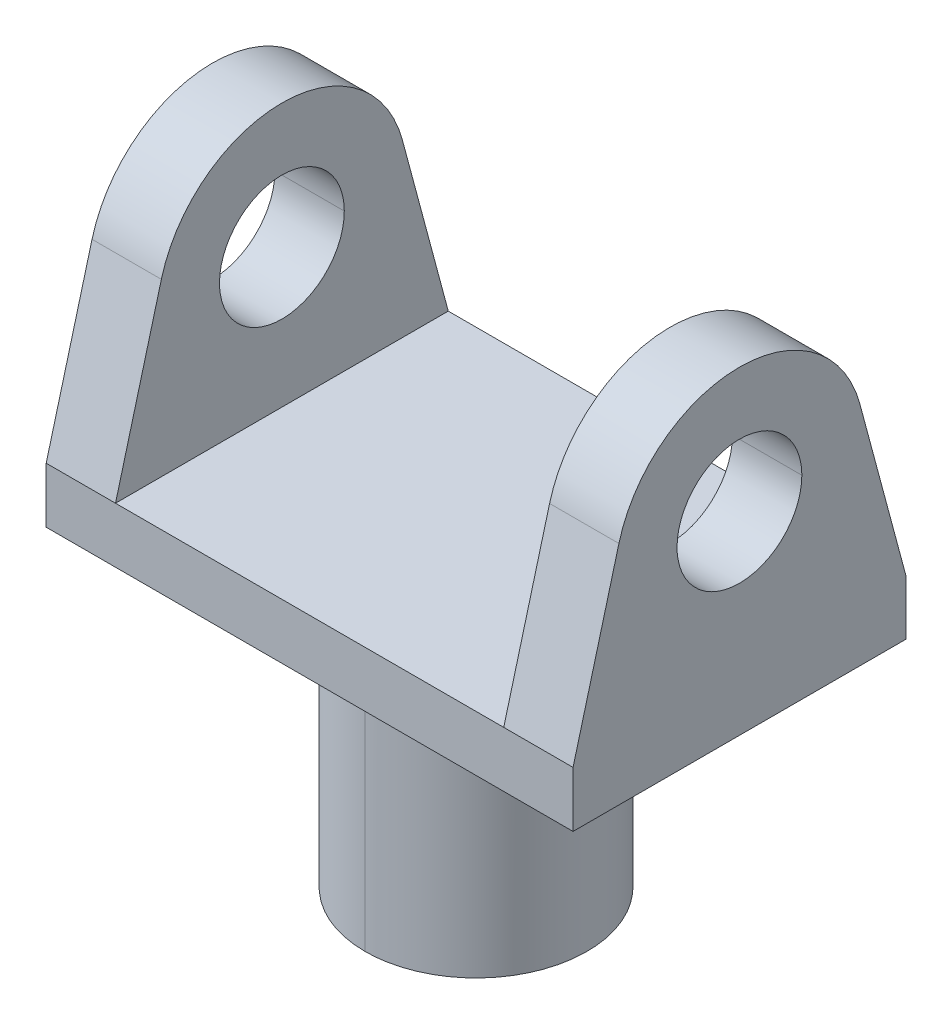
ISO-10303-21;
HEADER;
FILE_DESCRIPTION(('STEP AP214'),'2;1');
FILE_NAME('part.step','',(''),(''),'','','');
FILE_SCHEMA(('AUTOMOTIVE_DESIGN { 1 0 10303 214 1 1 1 1 }'));
ENDSEC;
DATA;
#1=APPLICATION_CONTEXT('core data for automotive mechanical design processes');
#2=APPLICATION_PROTOCOL_DEFINITION('international standard','automotive_design',2000,#1);
#3=PRODUCT_CONTEXT('',#1,'mechanical');
#4=PRODUCT('Part','Part','',(#3));
#5=PRODUCT_RELATED_PRODUCT_CATEGORY('part','',(#4));
#6=PRODUCT_DEFINITION_FORMATION('','',#4);
#7=PRODUCT_DEFINITION_CONTEXT('part definition',#1,'design');
#8=PRODUCT_DEFINITION('design','',#6,#7);
#9=PRODUCT_DEFINITION_SHAPE('','',#8);
#10=(LENGTH_UNIT() NAMED_UNIT(*) SI_UNIT(.MILLI.,.METRE.));
#11=(NAMED_UNIT(*) PLANE_ANGLE_UNIT() SI_UNIT($,.RADIAN.));
#12=(NAMED_UNIT(*) SI_UNIT($,.STERADIAN.) SOLID_ANGLE_UNIT());
#13=UNCERTAINTY_MEASURE_WITH_UNIT(LENGTH_MEASURE(1.E-05),#10,'distance_accuracy_value','');
#14=(GEOMETRIC_REPRESENTATION_CONTEXT(3) GLOBAL_UNCERTAINTY_ASSIGNED_CONTEXT((#13)) GLOBAL_UNIT_ASSIGNED_CONTEXT((#10,
#11,#12)) REPRESENTATION_CONTEXT('',''));
#15=CARTESIAN_POINT('',(0.,0.,0.));
#16=DIRECTION('',(0.,0.,1.));
#17=DIRECTION('',(1.,0.,0.));
#18=AXIS2_PLACEMENT_3D('',#15,#16,#17);
#19=CARTESIAN_POINT('',(-14.,4.,-12.));
#20=DIRECTION('',(0.,1.,0.));
#21=DIRECTION('',(0.,0.,1.));
#22=AXIS2_PLACEMENT_3D('',#19,#20,#21);
#23=PLANE('',#22);
#24=CARTESIAN_POINT('',(-14.,4.,12.));
#25=DIRECTION('',(1.,0.,0.));
#26=VECTOR('',#25,1.);
#27=LINE('',#24,#26);
#28=CARTESIAN_POINT('',(-14.,4.,12.));
#29=VERTEX_POINT('',#28);
#30=CARTESIAN_POINT('',(14.,4.,12.));
#31=VERTEX_POINT('',#30);
#32=EDGE_CURVE('E11',#29,#31,#27,.T.);
#33=ORIENTED_EDGE('',*,*,#32,.T.);
#34=CARTESIAN_POINT('',(14.,4.,-12.));
#35=DIRECTION('',(0.,0.,1.));
#36=VECTOR('',#35,1.);
#37=LINE('',#34,#36);
#38=CARTESIAN_POINT('',(14.,4.,-12.));
#39=VERTEX_POINT('',#38);
#40=EDGE_CURVE('E26',#39,#31,#37,.T.);
#41=ORIENTED_EDGE('',*,*,#40,.F.);
#42=CARTESIAN_POINT('',(14.,4.,-12.));
#43=DIRECTION('',(-1.,0.,0.));
#44=VECTOR('',#43,1.);
#45=LINE('',#42,#44);
#46=CARTESIAN_POINT('',(-14.,4.,-12.));
#47=VERTEX_POINT('',#46);
#48=EDGE_CURVE('E445',#39,#47,#45,.T.);
#49=ORIENTED_EDGE('',*,*,#48,.T.);
#50=CARTESIAN_POINT('',(-14.,4.,-12.));
#51=DIRECTION('',(0.,0.,1.));
#52=VECTOR('',#51,1.);
#53=LINE('',#50,#52);
#54=EDGE_CURVE('E442',#47,#29,#53,.T.);
#55=ORIENTED_EDGE('',*,*,#54,.T.);
#56=EDGE_LOOP('',(#33,#41,#49,#55));
#57=FACE_BOUND('',#56,.T.);
#58=ADVANCED_FACE('F17',(#57),#23,.T.);
#59=CARTESIAN_POINT('',(-14.,4.,-12.));
#60=DIRECTION('',(1.,0.,0.));
#61=DIRECTION('',(0.,1.,0.));
#62=AXIS2_PLACEMENT_3D('',#59,#60,#61);
#63=PLANE('',#62);
#64=CARTESIAN_POINT('',(-14.,16.3313593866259,-8.69279951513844));
#65=DIRECTION('',(0.,-0.965866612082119,-0.259039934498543));
#66=VECTOR('',#65,1.);
#67=LINE('',#64,#66);
#68=CARTESIAN_POINT('',(-14.,16.331347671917,-8.69275583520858));
#69=VERTEX_POINT('',#68);
#70=EDGE_CURVE('E439',#69,#47,#67,.T.);
#71=ORIENTED_EDGE('',*,*,#70,.F.);
#72=CARTESIAN_POINT('',(-14.,14.,0.));
#73=DIRECTION('',(-1.,0.,0.));
#74=DIRECTION('',(0.,0.259039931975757,0.965866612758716));
#75=AXIS2_PLACEMENT_3D('',#72,#73,#74);
#76=CIRCLE('',#75,9.);
#77=CARTESIAN_POINT('',(-14.,16.3313560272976,8.69278698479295));
#78=VERTEX_POINT('',#77);
#79=EDGE_CURVE('E435',#78,#69,#76,.T.);
#80=ORIENTED_EDGE('',*,*,#79,.F.);
#81=CARTESIAN_POINT('',(-14.,4.00000000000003,12.));
#82=DIRECTION('',(0.,0.965866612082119,-0.259039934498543));
#83=VECTOR('',#82,1.);
#84=LINE('',#81,#83);
#85=EDGE_CURVE('E432',#29,#78,#84,.T.);
#86=ORIENTED_EDGE('',*,*,#85,.F.);
#87=ORIENTED_EDGE('',*,*,#54,.F.);
#88=EDGE_LOOP('',(#71,#80,#86,#87));
#89=FACE_BOUND('',#88,.T.);
#90=CARTESIAN_POINT('',(-14.,14.,-4.5));
#91=CARTESIAN_POINT('',(-14.,13.9997647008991,-4.5));
#92=CARTESIAN_POINT('',(-14.,13.9995294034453,-4.49999998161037));
#93=CARTESIAN_POINT('',(-14.,13.0289747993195,-4.49984827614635));
#94=CARTESIAN_POINT('',(-14.,12.0866983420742,-4.18697437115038));
#95=CARTESIAN_POINT('',(-14.,10.6734421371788,-3.13224492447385));
#96=CARTESIAN_POINT('',(-14.,10.1737251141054,-2.49778943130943));
#97=CARTESIAN_POINT('',(-14.,9.622840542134,-1.2092501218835));
#98=CARTESIAN_POINT('',(-14.,9.49997260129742,-0.6081804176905));
#99=CARTESIAN_POINT('',(-14.,9.50003960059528,0.8790309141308));
#100=CARTESIAN_POINT('',(-14.,9.75682833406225,1.7373965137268));
#101=CARTESIAN_POINT('',(-14.,10.7145541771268,3.1939900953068));
#102=CARTESIAN_POINT('',(-14.,11.3877094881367,3.7647691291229));
#103=CARTESIAN_POINT('',(-14.,12.7522533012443,4.3689504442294));
#104=CARTESIAN_POINT('',(-14.,13.3723513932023,4.4997411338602));
#105=CARTESIAN_POINT('',(-14.,14.,4.5));
#106=B_SPLINE_CURVE_WITH_KNOTS('',3,(#90,#91,#92,#93,#94,#95,#96,#97,#98,#99,#100,#101,#102,
#103,#104,#105),.UNSPECIFIED.,.F.,.F.,(4,2,2,2,2,2,2,4),(0.,4.95943433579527E-05,
0.204568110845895,0.371873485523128,0.500067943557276,0.685353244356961,0.867637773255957,1.),.UNSPECIFIED.);
#107=CARTESIAN_POINT('',(-14.,14.,-4.5));
#108=VERTEX_POINT('',#107);
#109=CARTESIAN_POINT('',(-14.,14.,4.5));
#110=VERTEX_POINT('',#109);
#111=EDGE_CURVE('E428',#108,#110,#106,.T.);
#112=ORIENTED_EDGE('',*,*,#111,.T.);
#113=CARTESIAN_POINT('',(-14.,14.,4.5));
#114=CARTESIAN_POINT('',(-14.,14.9508974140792,4.4996078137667));
#115=CARTESIAN_POINT('',(-14.,15.8756842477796,4.1996162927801));
#116=CARTESIAN_POINT('',(-14.,17.2869061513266,3.17402896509));
#117=CARTESIAN_POINT('',(-14.,17.7944527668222,2.5458609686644));
#118=CARTESIAN_POINT('',(-14.,18.3692068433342,1.2468617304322));
#119=CARTESIAN_POINT('',(-14.,18.4999717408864,0.627279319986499));
#120=CARTESIAN_POINT('',(-14.,18.5000408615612,-0.907021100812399));
#121=CARTESIAN_POINT('',(-14.,18.2267205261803,-1.7911249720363));
#122=CARTESIAN_POINT('',(-14.,17.2668964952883,-3.19443306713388));
#123=CARTESIAN_POINT('',(-14.,16.6535211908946,-3.71987599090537));
#124=CARTESIAN_POINT('',(-14.,15.3323061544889,-4.35049837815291));
#125=CARTESIAN_POINT('',(-14.,14.6709183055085,-4.5));
#126=CARTESIAN_POINT('',(-14.,14.,-4.5));
#127=B_SPLINE_CURVE_WITH_KNOTS('',3,(#113,#114,#115,#116,#117,#118,#119,#120,#121,#122,#123,
#124,#125,#126),.UNSPECIFIED.,.F.,.F.,(4,2,2,2,2,2,4),(0.,0.200521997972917,0.367836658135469,
0.500064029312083,0.691259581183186,0.85857551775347,1.),.UNSPECIFIED.);
#128=EDGE_CURVE('E425',#110,#108,#127,.T.);
#129=ORIENTED_EDGE('',*,*,#128,.T.);
#130=EDGE_LOOP('',(#112,#129));
#131=FACE_BOUND('',#130,.T.);
#132=ADVANCED_FACE('F800',(#89,#131),#63,.T.);
#133=CARTESIAN_POINT('',(-14.,14.,0.));
#134=DIRECTION('',(-1.,0.,0.));
#135=DIRECTION('',(0.,-1.,0.));
#136=AXIS2_PLACEMENT_3D('',#133,#134,#135);
#137=CYLINDRICAL_SURFACE('',#136,4.5);
#138=ORIENTED_EDGE('',*,*,#128,.F.);
#139=CARTESIAN_POINT('',(-14.,14.,4.5));
#140=DIRECTION('',(-1.,0.,0.));
#141=VECTOR('',#140,1.);
#142=LINE('',#139,#141);
#143=CARTESIAN_POINT('',(-19.,14.,4.5));
#144=VERTEX_POINT('',#143);
#145=EDGE_CURVE('E422',#110,#144,#142,.T.);
#146=ORIENTED_EDGE('',*,*,#145,.T.);
#147=CARTESIAN_POINT('',(-19.,14.,0.));
#148=DIRECTION('',(-1.,0.,0.));
#149=DIRECTION('',(0.,0.,1.));
#150=AXIS2_PLACEMENT_3D('',#147,#148,#149);
#151=CIRCLE('',#150,4.5);
#152=CARTESIAN_POINT('',(-19.,14.,-4.49999999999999));
#153=VERTEX_POINT('',#152);
#154=EDGE_CURVE('E416',#144,#153,#151,.T.);
#155=ORIENTED_EDGE('',*,*,#154,.T.);
#156=CARTESIAN_POINT('',(-19.,14.,-4.5));
#157=DIRECTION('',(1.,0.,0.));
#158=VECTOR('',#157,1.);
#159=LINE('',#156,#158);
#160=EDGE_CURVE('E407',#153,#108,#159,.T.);
#161=ORIENTED_EDGE('',*,*,#160,.T.);
#162=EDGE_LOOP('',(#138,#146,#155,#161));
#163=FACE_BOUND('',#162,.T.);
#164=ADVANCED_FACE('F804',(#163),#137,.F.);
#165=CARTESIAN_POINT('',(-14.,14.,0.));
#166=DIRECTION('',(-1.,0.,0.));
#167=DIRECTION('',(0.,1.,0.));
#168=AXIS2_PLACEMENT_3D('',#165,#166,#167);
#169=CYLINDRICAL_SURFACE('',#168,4.5);
#170=CARTESIAN_POINT('',(-19.,14.,0.));
#171=DIRECTION('',(-1.,0.,0.));
#172=DIRECTION('',(0.,0.,-1.));
#173=AXIS2_PLACEMENT_3D('',#170,#171,#172);
#174=CIRCLE('',#173,4.5);
#175=EDGE_CURVE('E403',#153,#144,#174,.T.);
#176=ORIENTED_EDGE('',*,*,#175,.T.);
#177=ORIENTED_EDGE('',*,*,#145,.F.);
#178=ORIENTED_EDGE('',*,*,#111,.F.);
#179=ORIENTED_EDGE('',*,*,#160,.F.);
#180=EDGE_LOOP('',(#176,#177,#178,#179));
#181=FACE_BOUND('',#180,.T.);
#182=ADVANCED_FACE('F809',(#181),#169,.F.);
#183=CARTESIAN_POINT('',(-19.,0.,12.));
#184=DIRECTION('',(-1.,0.,0.));
#185=DIRECTION('',(0.,1.,0.));
#186=AXIS2_PLACEMENT_3D('',#183,#184,#185);
#187=PLANE('',#186);
#188=CARTESIAN_POINT('',(-19.,0.,-12.));
#189=DIRECTION('',(0.,0.,1.));
#190=VECTOR('',#189,1.);
#191=LINE('',#188,#190);
#192=CARTESIAN_POINT('',(-19.,0.,-12.));
#193=VERTEX_POINT('',#192);
#194=CARTESIAN_POINT('',(-19.,0.,12.));
#195=VERTEX_POINT('',#194);
#196=EDGE_CURVE('E400',#193,#195,#191,.T.);
#197=ORIENTED_EDGE('',*,*,#196,.T.);
#198=CARTESIAN_POINT('',(-19.,4.,12.));
#199=DIRECTION('',(0.,-1.,0.));
#200=VECTOR('',#199,1.);
#201=LINE('',#198,#200);
#202=CARTESIAN_POINT('',(-19.,4.,12.));
#203=VERTEX_POINT('',#202);
#204=EDGE_CURVE('E397',#203,#195,#201,.T.);
#205=ORIENTED_EDGE('',*,*,#204,.F.);
#206=CARTESIAN_POINT('',(-19.,4.,12.));
#207=CARTESIAN_POINT('',(-19.,8.11046766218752,10.8976583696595));
#208=CARTESIAN_POINT('',(-19.,12.220935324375,9.79531673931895));
#209=CARTESIAN_POINT('',(-19.,16.3313593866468,8.69279951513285));
#210=B_SPLINE_CURVE_WITH_KNOTS('',3,(#206,#207,#208,#209),.UNSPECIFIED.,.F.,.F.,(4,4),(0.,1.),.UNSPECIFIED.);
#211=CARTESIAN_POINT('',(-19.,16.3313593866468,8.69279951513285));
#212=VERTEX_POINT('',#211);
#213=EDGE_CURVE('E394',#203,#212,#210,.T.);
#214=ORIENTED_EDGE('',*,*,#213,.T.);
#215=CARTESIAN_POINT('',(-19.,16.3313593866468,8.69279951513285));
#216=CARTESIAN_POINT('',(-19.,17.6479375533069,8.33962774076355));
#217=CARTESIAN_POINT('',(-19.,18.866210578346,7.69298817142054));
#218=CARTESIAN_POINT('',(-19.,20.8933960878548,5.93501287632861));
#219=CARTESIAN_POINT('',(-19.,21.6884828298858,4.86106069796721));
#220=CARTESIAN_POINT('',(-19.,22.8316712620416,2.28885642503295));
#221=CARTESIAN_POINT('',(-19.,23.0886816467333,0.793849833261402));
#222=CARTESIAN_POINT('',(-19.,22.8339899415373,-2.4889749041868));
#223=CARTESIAN_POINT('',(-19.,22.1612563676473,-4.1980550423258));
#224=CARTESIAN_POINT('',(-19.,20.0448169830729,-6.8573004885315));
#225=CARTESIAN_POINT('',(-19.,18.7324851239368,-7.8209424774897));
#226=CARTESIAN_POINT('',(-19.,16.9416601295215,-8.5116101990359));
#227=CARTESIAN_POINT('',(-19.,16.6388058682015,-8.6103238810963));
#228=CARTESIAN_POINT('',(-19.,16.3313561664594,-8.6927869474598));
#229=CARTESIAN_POINT('',(-19.,16.3313560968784,-8.6927869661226));
#230=CARTESIAN_POINT('',(-19.,16.3313560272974,-8.6927869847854));
#231=B_SPLINE_CURVE_WITH_KNOTS('',3,(#215,#216,#217,#218,#219,#220,#221,#222,#223,#224,#225,
#226,#227,#228,#229,#230),.UNSPECIFIED.,.F.,.F.,(4,2,2,2,2,2,2,4),(0.,0.378446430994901,
0.744922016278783,1.15989795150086,1.65892575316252,2.10335627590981,2.19172800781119,
2.19172802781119),.UNSPECIFIED.);
#232=CARTESIAN_POINT('',(-19.,16.3313560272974,-8.69278698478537));
#233=VERTEX_POINT('',#232);
#234=EDGE_CURVE('E391',#212,#233,#231,.T.);
#235=ORIENTED_EDGE('',*,*,#234,.T.);
#236=CARTESIAN_POINT('',(-19.,16.3313560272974,-8.6927869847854));
#237=CARTESIAN_POINT('',(-19.,12.2209123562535,-9.7952249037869));
#238=CARTESIAN_POINT('',(-19.,8.11045617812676,-10.8976124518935));
#239=CARTESIAN_POINT('',(-19.,4.,-12.));
#240=B_SPLINE_CURVE_WITH_KNOTS('',3,(#236,#237,#238,#239),.UNSPECIFIED.,.F.,.F.,(4,4),(0.,1.),.UNSPECIFIED.);
#241=CARTESIAN_POINT('',(-19.,4.,-12.));
#242=VERTEX_POINT('',#241);
#243=EDGE_CURVE('E387',#233,#242,#240,.T.);
#244=ORIENTED_EDGE('',*,*,#243,.T.);
#245=CARTESIAN_POINT('',(-19.,4.,-12.));
#246=DIRECTION('',(0.,-1.,0.));
#247=VECTOR('',#246,1.);
#248=LINE('',#245,#247);
#249=EDGE_CURVE('E382',#242,#193,#248,.T.);
#250=ORIENTED_EDGE('',*,*,#249,.T.);
#251=EDGE_LOOP('',(#197,#205,#214,#235,#244,#250));
#252=FACE_BOUND('',#251,.T.);
#253=ORIENTED_EDGE('',*,*,#154,.F.);
#254=ORIENTED_EDGE('',*,*,#175,.F.);
#255=EDGE_LOOP('',(#253,#254));
#256=FACE_BOUND('',#255,.T.);
#257=ADVANCED_FACE('F905',(#252,#256),#187,.T.);
#258=CARTESIAN_POINT('',(-19.,0.,-12.));
#259=DIRECTION('',(0.,0.,-1.));
#260=DIRECTION('',(0.,1.,0.));
#261=AXIS2_PLACEMENT_3D('',#258,#259,#260);
#262=PLANE('',#261);
#263=CARTESIAN_POINT('',(19.,0.,-12.));
#264=DIRECTION('',(-1.,0.,0.));
#265=VECTOR('',#264,1.);
#266=LINE('',#263,#265);
#267=CARTESIAN_POINT('',(19.,0.,-12.));
#268=VERTEX_POINT('',#267);
#269=EDGE_CURVE('E376',#268,#193,#266,.T.);
#270=ORIENTED_EDGE('',*,*,#269,.T.);
#271=ORIENTED_EDGE('',*,*,#249,.F.);
#272=CARTESIAN_POINT('',(-14.,4.,-12.));
#273=DIRECTION('',(-1.,0.,0.));
#274=VECTOR('',#273,1.);
#275=LINE('',#272,#274);
#276=EDGE_CURVE('E372',#47,#242,#275,.T.);
#277=ORIENTED_EDGE('',*,*,#276,.F.);
#278=ORIENTED_EDGE('',*,*,#48,.F.);
#279=CARTESIAN_POINT('',(19.,4.00000000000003,-12.));
#280=DIRECTION('',(-1.,0.,0.));
#281=VECTOR('',#280,1.);
#282=LINE('',#279,#281);
#283=CARTESIAN_POINT('',(19.,3.99999999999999,-12.));
#284=VERTEX_POINT('',#283);
#285=EDGE_CURVE('E367',#284,#39,#282,.T.);
#286=ORIENTED_EDGE('',*,*,#285,.F.);
#287=CARTESIAN_POINT('',(19.,3.99999999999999,-12.));
#288=DIRECTION('',(0.,-1.,0.));
#289=VECTOR('',#288,1.);
#290=LINE('',#287,#289);
#291=EDGE_CURVE('E362',#284,#268,#290,.T.);
#292=ORIENTED_EDGE('',*,*,#291,.T.);
#293=EDGE_LOOP('',(#270,#271,#277,#278,#286,#292));
#294=FACE_BOUND('',#293,.T.);
#295=ADVANCED_FACE('F884',(#294),#262,.T.);
#296=CARTESIAN_POINT('',(19.,0.,-12.));
#297=DIRECTION('',(1.,0.,0.));
#298=DIRECTION('',(0.,1.,0.));
#299=AXIS2_PLACEMENT_3D('',#296,#297,#298);
#300=PLANE('',#299);
#301=CARTESIAN_POINT('',(19.,0.,12.));
#302=DIRECTION('',(0.,0.,-1.));
#303=VECTOR('',#302,1.);
#304=LINE('',#301,#303);
#305=CARTESIAN_POINT('',(19.,0.,12.));
#306=VERTEX_POINT('',#305);
#307=EDGE_CURVE('E359',#306,#268,#304,.T.);
#308=ORIENTED_EDGE('',*,*,#307,.T.);
#309=ORIENTED_EDGE('',*,*,#291,.F.);
#310=CARTESIAN_POINT('',(19.,16.331359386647,-8.69279951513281));
#311=DIRECTION('',(0.,-0.965866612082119,-0.259039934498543));
#312=VECTOR('',#311,1.);
#313=LINE('',#310,#312);
#314=CARTESIAN_POINT('',(19.,16.3313476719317,-8.69275583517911));
#315=VERTEX_POINT('',#314);
#316=EDGE_CURVE('E356',#315,#284,#313,.T.);
#317=ORIENTED_EDGE('',*,*,#316,.F.);
#318=CARTESIAN_POINT('',(19.,14.,0.));
#319=DIRECTION('',(-1.,0.,0.));
#320=DIRECTION('',(0.,0.25903993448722,0.965866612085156));
#321=AXIS2_PLACEMENT_3D('',#318,#319,#320);
#322=CIRCLE('',#321,9.);
#323=CARTESIAN_POINT('',(19.,16.3313560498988,8.69278697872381));
#324=VERTEX_POINT('',#323);
#325=EDGE_CURVE('E353',#324,#315,#322,.T.);
#326=ORIENTED_EDGE('',*,*,#325,.F.);
#327=CARTESIAN_POINT('',(19.,4.,12.));
#328=DIRECTION('',(0.,0.965866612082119,-0.259039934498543));
#329=VECTOR('',#328,1.);
#330=LINE('',#327,#329);
#331=CARTESIAN_POINT('',(19.,4.,12.));
#332=VERTEX_POINT('',#331);
#333=EDGE_CURVE('E348',#332,#324,#330,.T.);
#334=ORIENTED_EDGE('',*,*,#333,.F.);
#335=CARTESIAN_POINT('',(19.,4.,12.));
#336=DIRECTION('',(0.,-1.,0.));
#337=VECTOR('',#336,1.);
#338=LINE('',#335,#337);
#339=EDGE_CURVE('E345',#332,#306,#338,.T.);
#340=ORIENTED_EDGE('',*,*,#339,.T.);
#341=EDGE_LOOP('',(#308,#309,#317,#326,#334,#340));
#342=FACE_BOUND('',#341,.T.);
#343=CARTESIAN_POINT('',(19.,14.,4.5));
#344=CARTESIAN_POINT('',(19.,14.8197492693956,4.4996669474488));
#345=CARTESIAN_POINT('',(19.,15.6227268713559,4.2766512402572));
#346=CARTESIAN_POINT('',(19.,17.0040291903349,3.443031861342));
#347=CARTESIAN_POINT('',(19.,17.5632568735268,2.8603577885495));
#348=CARTESIAN_POINT('',(19.,18.3777639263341,1.3766605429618));
#349=CARTESIAN_POINT('',(19.,18.5639950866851,0.477627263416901));
#350=CARTESIAN_POINT('',(19.,18.3802043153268,-1.4958009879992));
#351=CARTESIAN_POINT('',(19.,17.8945324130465,-2.50054768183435));
#352=CARTESIAN_POINT('',(19.,16.4173051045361,-3.91588155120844));
#353=CARTESIAN_POINT('',(19.,15.5271154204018,-4.34122325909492));
#354=CARTESIAN_POINT('',(19.,14.3818397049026,-4.48775452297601));
#355=CARTESIAN_POINT('',(19.,14.1910108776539,-4.49992239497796));
#356=CARTESIAN_POINT('',(19.,14.,-4.5));
#357=B_SPLINE_CURVE_WITH_KNOTS('',3,(#343,#344,#345,#346,#347,#348,#349,#350,#351,#352,#353,
#354,#355,#356),.UNSPECIFIED.,.F.,.F.,(4,2,2,2,2,2,4),(0.,0.172639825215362,0.339729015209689,
0.529069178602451,0.756944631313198,0.959776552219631,1.),.UNSPECIFIED.);
#358=CARTESIAN_POINT('',(19.,14.,4.5));
#359=VERTEX_POINT('',#358);
#360=CARTESIAN_POINT('',(19.,14.,-4.5));
#361=VERTEX_POINT('',#360);
#362=EDGE_CURVE('E340',#359,#361,#357,.T.);
#363=ORIENTED_EDGE('',*,*,#362,.T.);
#364=CARTESIAN_POINT('',(19.,14.,-4.5));
#365=CARTESIAN_POINT('',(19.,13.1802507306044,-4.49966694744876));
#366=CARTESIAN_POINT('',(19.,12.3772731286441,-4.2766512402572));
#367=CARTESIAN_POINT('',(19.,10.9959708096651,-3.443031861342));
#368=CARTESIAN_POINT('',(19.,10.4367431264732,-2.86035778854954));
#369=CARTESIAN_POINT('',(19.,9.62223607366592,-1.3766605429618));
#370=CARTESIAN_POINT('',(19.,9.43600491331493,-0.477627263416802));
#371=CARTESIAN_POINT('',(19.,9.61979568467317,1.4958009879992));
#372=CARTESIAN_POINT('',(19.,10.1054675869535,2.5005476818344));
#373=CARTESIAN_POINT('',(19.,11.5826948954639,3.9158815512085));
#374=CARTESIAN_POINT('',(19.,12.4728845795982,4.3412232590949));
#375=CARTESIAN_POINT('',(19.,13.6181602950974,4.487754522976));
#376=CARTESIAN_POINT('',(19.,13.8089891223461,4.499922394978));
#377=CARTESIAN_POINT('',(19.,14.,4.5));
#378=B_SPLINE_CURVE_WITH_KNOTS('',3,(#364,#365,#366,#367,#368,#369,#370,#371,#372,#373,#374,
#375,#376,#377),.UNSPECIFIED.,.F.,.F.,(4,2,2,2,2,2,4),(0.,0.172639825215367,0.339729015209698,
0.529069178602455,0.7569446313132,0.959776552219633,1.),.UNSPECIFIED.);
#379=EDGE_CURVE('E337',#361,#359,#378,.T.);
#380=ORIENTED_EDGE('',*,*,#379,.T.);
#381=EDGE_LOOP('',(#363,#380));
#382=FACE_BOUND('',#381,.T.);
#383=ADVANCED_FACE('F904',(#342,#382),#300,.T.);
#384=CARTESIAN_POINT('',(14.,14.,0.));
#385=DIRECTION('',(1.,0.,0.));
#386=DIRECTION('',(0.,1.,0.));
#387=AXIS2_PLACEMENT_3D('',#384,#385,#386);
#388=CYLINDRICAL_SURFACE('',#387,4.5);
#389=ORIENTED_EDGE('',*,*,#379,.F.);
#390=CARTESIAN_POINT('',(14.,14.,-4.5));
#391=DIRECTION('',(1.,0.,0.));
#392=VECTOR('',#391,1.);
#393=LINE('',#390,#392);
#394=CARTESIAN_POINT('',(14.,14.,-4.5));
#395=VERTEX_POINT('',#394);
#396=EDGE_CURVE('E333',#395,#361,#393,.T.);
#397=ORIENTED_EDGE('',*,*,#396,.F.);
#398=CARTESIAN_POINT('',(14.,14.,0.));
#399=DIRECTION('',(-1.,0.,0.));
#400=DIRECTION('',(0.,0.,-1.));
#401=AXIS2_PLACEMENT_3D('',#398,#399,#400);
#402=CIRCLE('',#401,4.5);
#403=CARTESIAN_POINT('',(14.,14.,4.5));
#404=VERTEX_POINT('',#403);
#405=EDGE_CURVE('E328',#395,#404,#402,.T.);
#406=ORIENTED_EDGE('',*,*,#405,.T.);
#407=CARTESIAN_POINT('',(19.,14.,4.5));
#408=DIRECTION('',(-1.,0.,0.));
#409=VECTOR('',#408,1.);
#410=LINE('',#407,#409);
#411=EDGE_CURVE('E320',#359,#404,#410,.T.);
#412=ORIENTED_EDGE('',*,*,#411,.F.);
#413=EDGE_LOOP('',(#389,#397,#406,#412));
#414=FACE_BOUND('',#413,.T.);
#415=ADVANCED_FACE('F1005',(#414),#388,.F.);
#416=CARTESIAN_POINT('',(14.,14.,0.));
#417=DIRECTION('',(1.,0.,0.));
#418=DIRECTION('',(0.,-1.,0.));
#419=AXIS2_PLACEMENT_3D('',#416,#417,#418);
#420=CYLINDRICAL_SURFACE('',#419,4.5);
#421=CARTESIAN_POINT('',(14.,14.,0.));
#422=DIRECTION('',(-1.,0.,0.));
#423=DIRECTION('',(0.,0.,1.));
#424=AXIS2_PLACEMENT_3D('',#421,#422,#423);
#425=CIRCLE('',#424,4.5);
#426=EDGE_CURVE('E316',#404,#395,#425,.T.);
#427=ORIENTED_EDGE('',*,*,#426,.T.);
#428=ORIENTED_EDGE('',*,*,#396,.T.);
#429=ORIENTED_EDGE('',*,*,#362,.F.);
#430=ORIENTED_EDGE('',*,*,#411,.T.);
#431=EDGE_LOOP('',(#427,#428,#429,#430));
#432=FACE_BOUND('',#431,.T.);
#433=ADVANCED_FACE('F1014',(#432),#420,.F.);
#434=CARTESIAN_POINT('',(14.,23.088669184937,-12.));
#435=DIRECTION('',(-1.,0.,0.));
#436=DIRECTION('',(0.,-1.,0.));
#437=AXIS2_PLACEMENT_3D('',#434,#435,#436);
#438=PLANE('',#437);
#439=CARTESIAN_POINT('',(14.,4.,12.));
#440=CARTESIAN_POINT('',(14.,8.1104593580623,10.8976449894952));
#441=CARTESIAN_POINT('',(14.,12.2209187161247,9.7952899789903));
#442=CARTESIAN_POINT('',(14.,16.3313476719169,8.6927558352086));
#443=B_SPLINE_CURVE_WITH_KNOTS('',3,(#439,#440,#441,#442),.UNSPECIFIED.,.F.,.F.,(4,4),(0.,1.),.UNSPECIFIED.);
#444=CARTESIAN_POINT('',(14.,16.331347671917,8.69275583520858));
#445=VERTEX_POINT('',#444);
#446=EDGE_CURVE('E313',#31,#445,#443,.T.);
#447=ORIENTED_EDGE('',*,*,#446,.T.);
#448=CARTESIAN_POINT('',(14.,16.3313476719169,8.6927558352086));
#449=CARTESIAN_POINT('',(14.,16.3313490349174,8.6927554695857));
#450=CARTESIAN_POINT('',(14.,16.3313503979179,8.6927551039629));
#451=CARTESIAN_POINT('',(14.,17.6479176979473,8.3395878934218));
#452=CARTESIAN_POINT('',(14.,18.8661917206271,7.6929499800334));
#453=CARTESIAN_POINT('',(14.,20.8933792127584,5.9349786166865));
#454=CARTESIAN_POINT('',(14.,21.6884669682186,4.8610287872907));
#455=CARTESIAN_POINT('',(14.,22.8316575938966,2.2888302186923));
#456=CARTESIAN_POINT('',(14.,23.088669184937,0.7938270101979));
#457=CARTESIAN_POINT('',(14.,22.8339801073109,-2.48899026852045));
#458=CARTESIAN_POINT('',(14.,22.1612479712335,-4.19806660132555));
#459=CARTESIAN_POINT('',(14.,20.0448111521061,-6.85730623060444));
#460=CARTESIAN_POINT('',(14.,18.7324804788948,-7.82094599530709));
#461=CARTESIAN_POINT('',(14.,16.9416568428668,-8.51161161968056));
#462=CARTESIAN_POINT('',(14.,16.6388028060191,-8.61032496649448));
#463=CARTESIAN_POINT('',(14.,16.3313567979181,-8.69278677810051));
#464=CARTESIAN_POINT('',(14.,16.3313564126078,-8.69278688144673));
#465=CARTESIAN_POINT('',(14.,16.3313560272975,-8.69278698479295));
#466=B_SPLINE_CURVE_WITH_KNOTS('',3,(#448,#449,#450,#451,#452,#453,#454,#455,#456,#457,#458,
#459,#460,#461,#462,#463,#464,#465),.UNSPECIFIED.,.F.,.F.,(4,2,2,2,2,2,2,2,4),(0.,
1.78760288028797E-07,0.172670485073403,0.339878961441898,0.529216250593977,0.75690311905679,
0.959679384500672,0.999999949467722,1.),.UNSPECIFIED.);
#467=CARTESIAN_POINT('',(14.,16.3313560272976,-8.69278698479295));
#468=VERTEX_POINT('',#467);
#469=EDGE_CURVE('E308',#445,#468,#466,.T.);
#470=ORIENTED_EDGE('',*,*,#469,.T.);
#471=CARTESIAN_POINT('',(14.,16.3313560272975,-8.69278698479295));
#472=CARTESIAN_POINT('',(14.,12.2209098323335,-9.79522558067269));
#473=CARTESIAN_POINT('',(14.,8.1104549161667,-10.8976127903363));
#474=CARTESIAN_POINT('',(14.,4.,-12.));
#475=B_SPLINE_CURVE_WITH_KNOTS('',3,(#471,#472,#473,#474),.UNSPECIFIED.,.F.,.F.,(4,4),(0.,1.),.UNSPECIFIED.);
#476=EDGE_CURVE('E300',#468,#39,#475,.T.);
#477=ORIENTED_EDGE('',*,*,#476,.T.);
#478=ORIENTED_EDGE('',*,*,#40,.T.);
#479=EDGE_LOOP('',(#447,#470,#477,#478));
#480=FACE_BOUND('',#479,.T.);
#481=ORIENTED_EDGE('',*,*,#405,.F.);
#482=ORIENTED_EDGE('',*,*,#426,.F.);
#483=EDGE_LOOP('',(#481,#482));
#484=FACE_BOUND('',#483,.T.);
#485=ADVANCED_FACE('F452',(#480,#484),#438,.T.);
#486=CARTESIAN_POINT('',(14.,16.3313593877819,-8.69279951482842));
#487=DIRECTION('',(0.,0.259039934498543,-0.965866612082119));
#488=DIRECTION('',(1.,0.,0.));
#489=AXIS2_PLACEMENT_3D('',#486,#487,#488);
#490=PLANE('',#489);
#491=ORIENTED_EDGE('',*,*,#316,.T.);
#492=ORIENTED_EDGE('',*,*,#285,.T.);
#493=ORIENTED_EDGE('',*,*,#476,.F.);
#494=CARTESIAN_POINT('',(14.,16.3313593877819,-8.69279951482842));
#495=DIRECTION('',(1.,-2.26989260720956E-10,-6.08773448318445E-11));
#496=VECTOR('',#495,1.);
#497=LINE('',#494,#496);
#498=EDGE_CURVE('E292',#468,#315,#497,.T.);
#499=ORIENTED_EDGE('',*,*,#498,.T.);
#500=EDGE_LOOP('',(#491,#492,#493,#499));
#501=FACE_BOUND('',#500,.T.);
#502=ADVANCED_FACE('F1084',(#501),#490,.T.);
#503=CARTESIAN_POINT('',(14.,14.,0.));
#504=DIRECTION('',(1.,0.,0.));
#505=DIRECTION('',(0.,-1.,-1.21047616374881E-12));
#506=AXIS2_PLACEMENT_3D('',#503,#504,#505);
#507=CYLINDRICAL_SURFACE('',#506,9.);
#508=ORIENTED_EDGE('',*,*,#325,.T.);
#509=ORIENTED_EDGE('',*,*,#498,.F.);
#510=ORIENTED_EDGE('',*,*,#469,.F.);
#511=CARTESIAN_POINT('',(14.,16.3313593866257,8.6927995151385));
#512=CARTESIAN_POINT('',(14.2083333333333,16.3313593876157,8.692799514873));
#513=CARTESIAN_POINT('',(14.4166666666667,16.3313593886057,8.69279951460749));
#514=CARTESIAN_POINT('',(14.8333333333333,16.3313593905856,8.69279951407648));
#515=CARTESIAN_POINT('',(15.0416666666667,16.3313593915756,8.69279951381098));
#516=CARTESIAN_POINT('',(15.4583333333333,16.3313593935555,8.69279951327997));
#517=CARTESIAN_POINT('',(15.6666666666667,16.3313593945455,8.69279951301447));
#518=CARTESIAN_POINT('',(16.0833333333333,16.3313593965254,8.69279951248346));
#519=CARTESIAN_POINT('',(16.2916666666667,16.3313593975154,8.69279951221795));
#520=CARTESIAN_POINT('',(16.7083333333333,16.3313593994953,8.69279951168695));
#521=CARTESIAN_POINT('',(16.9166666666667,16.3313594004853,8.69279951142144));
#522=CARTESIAN_POINT('',(17.3333333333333,16.3313594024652,8.69279951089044));
#523=CARTESIAN_POINT('',(17.5416666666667,16.3313594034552,8.69279951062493));
#524=CARTESIAN_POINT('',(17.9583333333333,16.3313594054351,8.69279951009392));
#525=CARTESIAN_POINT('',(18.1666666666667,16.3313594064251,8.69279950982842));
#526=CARTESIAN_POINT('',(18.5833333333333,16.331359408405,8.69279950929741));
#527=CARTESIAN_POINT('',(18.7916666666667,16.331359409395,8.69279950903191));
#528=CARTESIAN_POINT('',(19.,16.331359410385,8.6927995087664));
#529=B_SPLINE_CURVE_WITH_KNOTS('',3,(#511,#512,#513,#514,#515,#516,#517,#518,#519,#520,#521,
#522,#523,#524,#525,#526,#527,#528),.UNSPECIFIED.,.F.,.F.,(4,2,2,2,2,2,2,2,4),(0.,
0.625000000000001,1.25,1.875,2.5,3.125,3.75,4.375,5.),.UNSPECIFIED.);
#530=EDGE_CURVE('E284',#445,#324,#529,.T.);
#531=ORIENTED_EDGE('',*,*,#530,.T.);
#532=EDGE_LOOP('',(#508,#509,#510,#531));
#533=FACE_BOUND('',#532,.T.);
#534=ADVANCED_FACE('F1168',(#533),#507,.T.);
#535=CARTESIAN_POINT('',(14.,4.,12.));
#536=DIRECTION('',(0.,0.259039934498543,0.965866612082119));
#537=DIRECTION('',(1.,0.,0.));
#538=AXIS2_PLACEMENT_3D('',#535,#536,#537);
#539=PLANE('',#538);
#540=ORIENTED_EDGE('',*,*,#333,.T.);
#541=ORIENTED_EDGE('',*,*,#530,.F.);
#542=ORIENTED_EDGE('',*,*,#446,.F.);
#543=CARTESIAN_POINT('',(14.,4.,12.));
#544=DIRECTION('',(1.,0.,0.));
#545=VECTOR('',#544,1.);
#546=LINE('',#543,#545);
#547=EDGE_CURVE('E275',#31,#332,#546,.T.);
#548=ORIENTED_EDGE('',*,*,#547,.T.);
#549=EDGE_LOOP('',(#540,#541,#542,#548));
#550=FACE_BOUND('',#549,.T.);
#551=ADVANCED_FACE('F457',(#550),#539,.T.);
#552=CARTESIAN_POINT('',(19.,0.,12.));
#553=DIRECTION('',(0.,0.,1.));
#554=DIRECTION('',(0.,1.,0.));
#555=AXIS2_PLACEMENT_3D('',#552,#553,#554);
#556=PLANE('',#555);
#557=CARTESIAN_POINT('',(-19.,0.,12.));
#558=DIRECTION('',(1.,0.,0.));
#559=VECTOR('',#558,1.);
#560=LINE('',#557,#559);
#561=EDGE_CURVE('E270',#195,#306,#560,.T.);
#562=ORIENTED_EDGE('',*,*,#561,.T.);
#563=ORIENTED_EDGE('',*,*,#339,.F.);
#564=ORIENTED_EDGE('',*,*,#547,.F.);
#565=ORIENTED_EDGE('',*,*,#32,.F.);
#566=CARTESIAN_POINT('',(-19.,4.00000000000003,12.));
#567=DIRECTION('',(1.,0.,0.));
#568=VECTOR('',#567,1.);
#569=LINE('',#566,#568);
#570=EDGE_CURVE('E262',#203,#29,#569,.T.);
#571=ORIENTED_EDGE('',*,*,#570,.F.);
#572=ORIENTED_EDGE('',*,*,#204,.T.);
#573=EDGE_LOOP('',(#562,#563,#564,#565,#571,#572));
#574=FACE_BOUND('',#573,.T.);
#575=ADVANCED_FACE('F462',(#574),#556,.T.);
#576=CARTESIAN_POINT('',(-19.,16.3313593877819,8.69279951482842));
#577=DIRECTION('',(0.,0.259039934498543,0.965866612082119));
#578=DIRECTION('',(0.,-0.965866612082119,0.259039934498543));
#579=AXIS2_PLACEMENT_3D('',#576,#577,#578);
#580=PLANE('',#579);
#581=ORIENTED_EDGE('',*,*,#213,.F.);
#582=ORIENTED_EDGE('',*,*,#570,.T.);
#583=ORIENTED_EDGE('',*,*,#85,.T.);
#584=CARTESIAN_POINT('',(-14.,16.3313593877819,8.69279951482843));
#585=DIRECTION('',(-1.,-2.27014240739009E-10,6.08839367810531E-11));
#586=VECTOR('',#585,1.);
#587=LINE('',#584,#586);
#588=EDGE_CURVE('E253',#78,#212,#587,.T.);
#589=ORIENTED_EDGE('',*,*,#588,.T.);
#590=EDGE_LOOP('',(#581,#582,#583,#589));
#591=FACE_BOUND('',#590,.T.);
#592=ADVANCED_FACE('F482',(#591),#580,.T.);
#593=CARTESIAN_POINT('',(-14.,14.,0.));
#594=DIRECTION('',(-1.,0.,0.));
#595=DIRECTION('',(0.,-1.,1.20997656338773E-12));
#596=AXIS2_PLACEMENT_3D('',#593,#594,#595);
#597=CYLINDRICAL_SURFACE('',#596,9.);
#598=ORIENTED_EDGE('',*,*,#234,.F.);
#599=ORIENTED_EDGE('',*,*,#588,.F.);
#600=ORIENTED_EDGE('',*,*,#79,.T.);
#601=CARTESIAN_POINT('',(-14.,16.3313593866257,-8.69279951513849));
#602=CARTESIAN_POINT('',(-14.2083333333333,16.331359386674,-8.69279951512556));
#603=CARTESIAN_POINT('',(-14.4166666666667,16.3313593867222,-8.69279951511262));
#604=CARTESIAN_POINT('',(-14.8333333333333,16.3313593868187,-8.69279951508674));
#605=CARTESIAN_POINT('',(-15.0416666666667,16.3313593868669,-8.6927995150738));
#606=CARTESIAN_POINT('',(-15.4583333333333,16.3313593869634,-8.69279951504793));
#607=CARTESIAN_POINT('',(-15.6666666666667,16.3313593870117,-8.69279951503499));
#608=CARTESIAN_POINT('',(-16.0833333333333,16.3313593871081,-8.69279951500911));
#609=CARTESIAN_POINT('',(-16.2916666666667,16.3313593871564,-8.69279951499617));
#610=CARTESIAN_POINT('',(-16.7083333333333,16.3313593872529,-8.6927995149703));
#611=CARTESIAN_POINT('',(-16.9166666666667,16.3313593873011,-8.69279951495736));
#612=CARTESIAN_POINT('',(-17.3333333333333,16.3313593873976,-8.69279951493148));
#613=CARTESIAN_POINT('',(-17.5416666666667,16.3313593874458,-8.69279951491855));
#614=CARTESIAN_POINT('',(-17.9583333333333,16.3313593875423,-8.69279951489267));
#615=CARTESIAN_POINT('',(-18.1666666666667,16.3313593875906,-8.69279951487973));
#616=CARTESIAN_POINT('',(-18.5833333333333,16.331359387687,-8.69279951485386));
#617=CARTESIAN_POINT('',(-18.7916666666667,16.3313593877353,-8.69279951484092));
#618=CARTESIAN_POINT('',(-19.,16.3313593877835,-8.69279951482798));
#619=B_SPLINE_CURVE_WITH_KNOTS('',3,(#601,#602,#603,#604,#605,#606,#607,#608,#609,#610,#611,
#612,#613,#614,#615,#616,#617,#618),.UNSPECIFIED.,.F.,.F.,(4,2,2,2,2,2,2,2,4),(0.,
0.624999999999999,1.25,1.875,2.5,3.125,3.75,4.375,5.),.UNSPECIFIED.);
#620=EDGE_CURVE('E249',#69,#233,#619,.T.);
#621=ORIENTED_EDGE('',*,*,#620,.T.);
#622=EDGE_LOOP('',(#598,#599,#600,#621));
#623=FACE_BOUND('',#622,.T.);
#624=ADVANCED_FACE('F548',(#623),#597,.T.);
#625=CARTESIAN_POINT('',(-19.,4.,-12.));
#626=DIRECTION('',(0.,0.259039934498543,-0.965866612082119));
#627=DIRECTION('',(0.,0.965866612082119,0.259039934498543));
#628=AXIS2_PLACEMENT_3D('',#625,#626,#627);
#629=PLANE('',#628);
#630=ORIENTED_EDGE('',*,*,#243,.F.);
#631=ORIENTED_EDGE('',*,*,#620,.F.);
#632=ORIENTED_EDGE('',*,*,#70,.T.);
#633=ORIENTED_EDGE('',*,*,#276,.T.);
#634=EDGE_LOOP('',(#630,#631,#632,#633));
#635=FACE_BOUND('',#634,.T.);
#636=ADVANCED_FACE('F557',(#635),#629,.T.);
#637=CARTESIAN_POINT('',(-19.,0.,-12.));
#638=DIRECTION('',(0.,-1.,0.));
#639=DIRECTION('',(1.,0.,0.));
#640=AXIS2_PLACEMENT_3D('',#637,#638,#639);
#641=PLANE('',#640);
#642=ORIENTED_EDGE('',*,*,#196,.F.);
#643=ORIENTED_EDGE('',*,*,#269,.F.);
#644=ORIENTED_EDGE('',*,*,#307,.F.);
#645=ORIENTED_EDGE('',*,*,#561,.F.);
#646=EDGE_LOOP('',(#642,#643,#644,#645));
#647=FACE_BOUND('',#646,.T.);
#648=CARTESIAN_POINT('',(0.,0.,0.));
#649=DIRECTION('',(0.,-1.,0.));
#650=DIRECTION('',(0.,0.,1.));
#651=AXIS2_PLACEMENT_3D('',#648,#649,#650);
#652=CIRCLE('',#651,8.);
#653=CARTESIAN_POINT('',(0.,0.,8.00000001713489));
#654=VERTEX_POINT('',#653);
#655=CARTESIAN_POINT('',(0.,0.,-8.00000001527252));
#656=VERTEX_POINT('',#655);
#657=EDGE_CURVE('E245',#654,#656,#652,.T.);
#658=ORIENTED_EDGE('',*,*,#657,.F.);
#659=CARTESIAN_POINT('',(0.,0.,0.));
#660=DIRECTION('',(0.,-1.,0.));
#661=DIRECTION('',(0.,0.,-1.));
#662=AXIS2_PLACEMENT_3D('',#659,#660,#661);
#663=CIRCLE('',#662,8.);
#664=EDGE_CURVE('E241',#656,#654,#663,.T.);
#665=ORIENTED_EDGE('',*,*,#664,.F.);
#666=EDGE_LOOP('',(#658,#665));
#667=FACE_BOUND('',#666,.T.);
#668=ADVANCED_FACE('F627',(#647,#667),#641,.T.);
#669=CARTESIAN_POINT('',(0.,-19.,0.));
#670=DIRECTION('',(0.,1.,0.));
#671=DIRECTION('',(-1.,0.,0.));
#672=AXIS2_PLACEMENT_3D('',#669,#670,#671);
#673=CYLINDRICAL_SURFACE('',#672,8.);
#674=ORIENTED_EDGE('',*,*,#664,.T.);
#675=CARTESIAN_POINT('',(0.,-19.,8.));
#676=DIRECTION('',(0.,1.,0.));
#677=VECTOR('',#676,1.);
#678=LINE('',#675,#677);
#679=CARTESIAN_POINT('',(0.,-19.,8.));
#680=VERTEX_POINT('',#679);
#681=EDGE_CURVE('E237',#680,#654,#678,.T.);
#682=ORIENTED_EDGE('',*,*,#681,.F.);
#683=CARTESIAN_POINT('',(0.,-19.,-8.));
#684=CARTESIAN_POINT('',(1.45733203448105,-19.,-7.9994079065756));
#685=CARTESIAN_POINT('',(2.8848477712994,-19.,-7.602935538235));
#686=CARTESIAN_POINT('',(5.3404963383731,-19.,-6.1209455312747));
#687=CARTESIAN_POINT('',(6.3346788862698,-19.,-5.0850805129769));
#688=CARTESIAN_POINT('',(7.6611183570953,-19.,-2.6688527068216));
#689=CARTESIAN_POINT('',(8.,-19.,-1.34624322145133));
#690=CARTESIAN_POINT('',(8.,-19.,1.61930651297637));
#691=CARTESIAN_POINT('',(7.5097013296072,-19.,3.19800025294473));
#692=CARTESIAN_POINT('',(5.7401062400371,-19.,5.77136312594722));
#693=CARTESIAN_POINT('',(4.5553666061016,-19.,6.74627236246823));
#694=CARTESIAN_POINT('',(2.1718493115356,-19.,7.77675373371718));
#695=CARTESIAN_POINT('',(1.09220183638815,-19.,7.99955625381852));
#696=CARTESIAN_POINT('',(0.,-19.,8.));
#697=B_SPLINE_CURVE_WITH_KNOTS('',3,(#683,#684,#685,#686,#687,#688,#689,#690,#691,#692,#693,
#694,#695,#696),.UNSPECIFIED.,.F.,.F.,(4,2,2,2,2,2,4),(0.,0.172904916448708,0.340250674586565,
0.499910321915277,0.69195430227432,0.870407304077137,1.),.UNSPECIFIED.);
#698=CARTESIAN_POINT('',(0.,-19.,-8.));
#699=VERTEX_POINT('',#698);
#700=EDGE_CURVE('E231',#699,#680,#697,.T.);
#701=ORIENTED_EDGE('',*,*,#700,.F.);
#702=CARTESIAN_POINT('',(0.,0.,-8.));
#703=DIRECTION('',(0.,-1.,0.));
#704=VECTOR('',#703,1.);
#705=LINE('',#702,#704);
#706=EDGE_CURVE('E224',#656,#699,#705,.T.);
#707=ORIENTED_EDGE('',*,*,#706,.F.);
#708=EDGE_LOOP('',(#674,#682,#701,#707));
#709=FACE_BOUND('',#708,.T.);
#710=ADVANCED_FACE('F636',(#709),#673,.T.);
#711=CARTESIAN_POINT('',(0.,-19.,0.));
#712=DIRECTION('',(0.,1.,0.));
#713=DIRECTION('',(1.,0.,0.));
#714=AXIS2_PLACEMENT_3D('',#711,#712,#713);
#715=CYLINDRICAL_SURFACE('',#714,8.);
#716=CARTESIAN_POINT('',(0.,-19.,8.));
#717=CARTESIAN_POINT('',(-1.45733203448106,-19.,7.9994079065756));
#718=CARTESIAN_POINT('',(-2.88484777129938,-19.,7.60293553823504));
#719=CARTESIAN_POINT('',(-5.34049633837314,-19.,6.12094553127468));
#720=CARTESIAN_POINT('',(-6.3346788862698,-19.,5.08508051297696));
#721=CARTESIAN_POINT('',(-7.66111835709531,-19.,2.66885270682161));
#722=CARTESIAN_POINT('',(-8.,-19.,1.34624322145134));
#723=CARTESIAN_POINT('',(-8.,-19.,-1.61930651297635));
#724=CARTESIAN_POINT('',(-7.50970132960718,-19.,-3.1980002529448));
#725=CARTESIAN_POINT('',(-5.74010624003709,-19.,-5.7713631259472));
#726=CARTESIAN_POINT('',(-4.55536660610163,-19.,-6.7462723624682));
#727=CARTESIAN_POINT('',(-2.1718493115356,-19.,-7.7767537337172));
#728=CARTESIAN_POINT('',(-1.09220183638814,-19.,-7.9995562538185));
#729=CARTESIAN_POINT('',(0.,-19.,-8.));
#730=B_SPLINE_CURVE_WITH_KNOTS('',3,(#716,#717,#718,#719,#720,#721,#722,#723,#724,#725,#726,
#727,#728,#729),.UNSPECIFIED.,.F.,.F.,(4,2,2,2,2,2,4),(0.,0.172904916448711,0.34025067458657,
0.499910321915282,0.691954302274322,0.870407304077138,1.),.UNSPECIFIED.);
#731=EDGE_CURVE('E221',#680,#699,#730,.T.);
#732=ORIENTED_EDGE('',*,*,#731,.F.);
#733=ORIENTED_EDGE('',*,*,#681,.T.);
#734=ORIENTED_EDGE('',*,*,#657,.T.);
#735=ORIENTED_EDGE('',*,*,#706,.T.);
#736=EDGE_LOOP('',(#732,#733,#734,#735));
#737=FACE_BOUND('',#736,.T.);
#738=ADVANCED_FACE('F704',(#737),#715,.T.);
#739=CARTESIAN_POINT('',(-8.,-19.,8.));
#740=DIRECTION('',(0.,-1.,0.));
#741=DIRECTION('',(0.,0.,-1.));
#742=AXIS2_PLACEMENT_3D('',#739,#740,#741);
#743=PLANE('',#742);
#744=ORIENTED_EDGE('',*,*,#700,.T.);
#745=ORIENTED_EDGE('',*,*,#731,.T.);
#746=EDGE_LOOP('',(#744,#745));
#747=FACE_BOUND('',#746,.T.);
#748=CARTESIAN_POINT('',(0.,-19.,0.311891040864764));
#749=DIRECTION('',(0.,-1.,0.));
#750=DIRECTION('',(0.,0.,1.));
#751=AXIS2_PLACEMENT_3D('',#748,#749,#750);
#752=CIRCLE('',#751,4.);
#753=CARTESIAN_POINT('',(0.,-19.,4.31189104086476));
#754=VERTEX_POINT('',#753);
#755=CARTESIAN_POINT('',(0.,-19.,-3.68810895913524));
#756=VERTEX_POINT('',#755);
#757=EDGE_CURVE('E162',#754,#756,#752,.T.);
#758=ORIENTED_EDGE('',*,*,#757,.F.);
#759=CARTESIAN_POINT('',(0.,-19.,0.311891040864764));
#760=DIRECTION('',(0.,-1.,0.));
#761=DIRECTION('',(0.,0.,-1.));
#762=AXIS2_PLACEMENT_3D('',#759,#760,#761);
#763=CIRCLE('',#762,4.);
#764=EDGE_CURVE('E216',#756,#754,#763,.T.);
#765=ORIENTED_EDGE('',*,*,#764,.F.);
#766=EDGE_LOOP('',(#758,#765));
#767=FACE_BOUND('',#766,.T.);
#768=ADVANCED_FACE('F716',(#747,#767),#743,.T.);
#769=CARTESIAN_POINT('',(0.,-19.,0.311891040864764));
#770=DIRECTION('',(0.,1.,0.));
#771=DIRECTION('',(-1.,0.,0.));
#772=AXIS2_PLACEMENT_3D('',#769,#770,#771);
#773=CYLINDRICAL_SURFACE('',#772,4.);
#774=ORIENTED_EDGE('',*,*,#764,.T.);
#775=CARTESIAN_POINT('',(0.,-19.,4.31189104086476));
#776=DIRECTION('',(0.,1.,0.));
#777=VECTOR('',#776,1.);
#778=LINE('',#775,#777);
#779=CARTESIAN_POINT('',(0.,0.,4.31189104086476));
#780=VERTEX_POINT('',#779);
#781=EDGE_CURVE('E148',#754,#780,#778,.T.);
#782=ORIENTED_EDGE('',*,*,#781,.T.);
#783=CARTESIAN_POINT('',(0.,0.,-3.68810895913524));
#784=CARTESIAN_POINT('',(0.72866601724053,0.,-3.68781291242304));
#785=CARTESIAN_POINT('',(1.44242388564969,0.,-3.48957672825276));
#786=CARTESIAN_POINT('',(2.67024816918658,0.,-2.74858172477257));
#787=CARTESIAN_POINT('',(3.1673394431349,0.,-2.23064921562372));
#788=CARTESIAN_POINT('',(3.89134571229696,0.,-0.91180721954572));
#789=CARTESIAN_POINT('',(4.05688452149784,0.,-0.11266652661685));
#790=CARTESIAN_POINT('',(3.89351494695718,0.,1.64149191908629));
#791=CARTESIAN_POINT('',(3.46180658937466,0.,2.53460009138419));
#792=CARTESIAN_POINT('',(2.14871564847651,0.,3.79267464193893));
#793=CARTESIAN_POINT('',(1.35743592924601,0.,4.17075616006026));
#794=CARTESIAN_POINT('',(0.33941307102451,0.,4.301006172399));
#795=CARTESIAN_POINT('',(0.16978744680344,0.,4.31182205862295));
#796=CARTESIAN_POINT('',(0.,0.,4.31189104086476));
#797=B_SPLINE_CURVE_WITH_KNOTS('',3,(#783,#784,#785,#786,#787,#788,#789,#790,#791,#792,#793,
#794,#795,#796),.UNSPECIFIED.,.F.,.F.,(4,2,2,2,2,2,4),(0.,0.172639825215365,0.339729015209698,
0.529069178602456,0.756944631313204,0.959776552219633,1.),.UNSPECIFIED.);
#798=CARTESIAN_POINT('',(0.,0.,-3.68810895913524));
#799=VERTEX_POINT('',#798);
#800=EDGE_CURVE('E139',#799,#780,#797,.T.);
#801=ORIENTED_EDGE('',*,*,#800,.F.);
#802=CARTESIAN_POINT('',(0.,0.,-3.68810895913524));
#803=DIRECTION('',(0.,-1.,0.));
#804=VECTOR('',#803,1.);
#805=LINE('',#802,#804);
#806=EDGE_CURVE('E144',#799,#756,#805,.T.);
#807=ORIENTED_EDGE('',*,*,#806,.T.);
#808=EDGE_LOOP('',(#774,#782,#801,#807));
#809=FACE_BOUND('',#808,.T.);
#810=ADVANCED_FACE('F143',(#809),#773,.F.);
#811=CARTESIAN_POINT('',(0.,-19.,0.311891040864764));
#812=DIRECTION('',(0.,1.,0.));
#813=DIRECTION('',(1.,0.,0.));
#814=AXIS2_PLACEMENT_3D('',#811,#812,#813);
#815=CYLINDRICAL_SURFACE('',#814,4.);
#816=CARTESIAN_POINT('',(0.,0.,4.31189104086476));
#817=CARTESIAN_POINT('',(-0.72866601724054,0.,4.31159499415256));
#818=CARTESIAN_POINT('',(-1.44242388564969,0.,4.11335880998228));
#819=CARTESIAN_POINT('',(-2.67024816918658,0.,3.37236380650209));
#820=CARTESIAN_POINT('',(-3.1673394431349,0.,2.85443129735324));
#821=CARTESIAN_POINT('',(-3.89134571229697,0.,1.53558930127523));
#822=CARTESIAN_POINT('',(-4.05688452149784,0.,0.73644860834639));
#823=CARTESIAN_POINT('',(-3.89351494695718,0.,-1.01770983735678));
#824=CARTESIAN_POINT('',(-3.46180658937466,0.,-1.91081800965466));
#825=CARTESIAN_POINT('',(-2.14871564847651,0.,-3.16889256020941));
#826=CARTESIAN_POINT('',(-1.357435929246,0.,-3.54697407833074));
#827=CARTESIAN_POINT('',(-0.33941307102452,0.,-3.67722409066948));
#828=CARTESIAN_POINT('',(-0.16978744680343,0.,-3.68803997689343));
#829=CARTESIAN_POINT('',(0.,0.,-3.68810895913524));
#830=B_SPLINE_CURVE_WITH_KNOTS('',3,(#816,#817,#818,#819,#820,#821,#822,#823,#824,#825,#826,
#827,#828,#829),.UNSPECIFIED.,.F.,.F.,(4,2,2,2,2,2,4),(0.,0.172639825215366,0.339729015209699,
0.529069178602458,0.756944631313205,0.959776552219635,1.),.UNSPECIFIED.);
#831=EDGE_CURVE('E160',#780,#799,#830,.T.);
#832=ORIENTED_EDGE('',*,*,#831,.F.);
#833=ORIENTED_EDGE('',*,*,#781,.F.);
#834=ORIENTED_EDGE('',*,*,#757,.T.);
#835=ORIENTED_EDGE('',*,*,#806,.F.);
#836=EDGE_LOOP('',(#832,#833,#834,#835));
#837=FACE_BOUND('',#836,.T.);
#838=ADVANCED_FACE('F159',(#837),#815,.F.);
#839=CARTESIAN_POINT('',(-4.05688452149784,0.,-3.68810895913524));
#840=DIRECTION('',(0.,-1.,0.));
#841=DIRECTION('',(1.,0.,0.));
#842=AXIS2_PLACEMENT_3D('',#839,#840,#841);
#843=PLANE('',#842);
#844=ORIENTED_EDGE('',*,*,#800,.T.);
#845=ORIENTED_EDGE('',*,*,#831,.T.);
#846=EDGE_LOOP('',(#844,#845));
#847=FACE_BOUND('',#846,.T.);
#848=ADVANCED_FACE('F168',(#847),#843,.T.);
#849=CLOSED_SHELL('',(#58,#132,#164,#182,#257,#295,#383,#415,#433,#485,#502,#534,#551,#575,#592,
#624,#636,#668,#710,#738,#768,#810,#838,#848));
#850=MANIFOLD_SOLID_BREP('B1',#849);
#851=ADVANCED_BREP_SHAPE_REPRESENTATION('',(#18,#850),#14);
#852=SHAPE_DEFINITION_REPRESENTATION(#9,#851);
ENDSEC;
END-ISO-10303-21;
